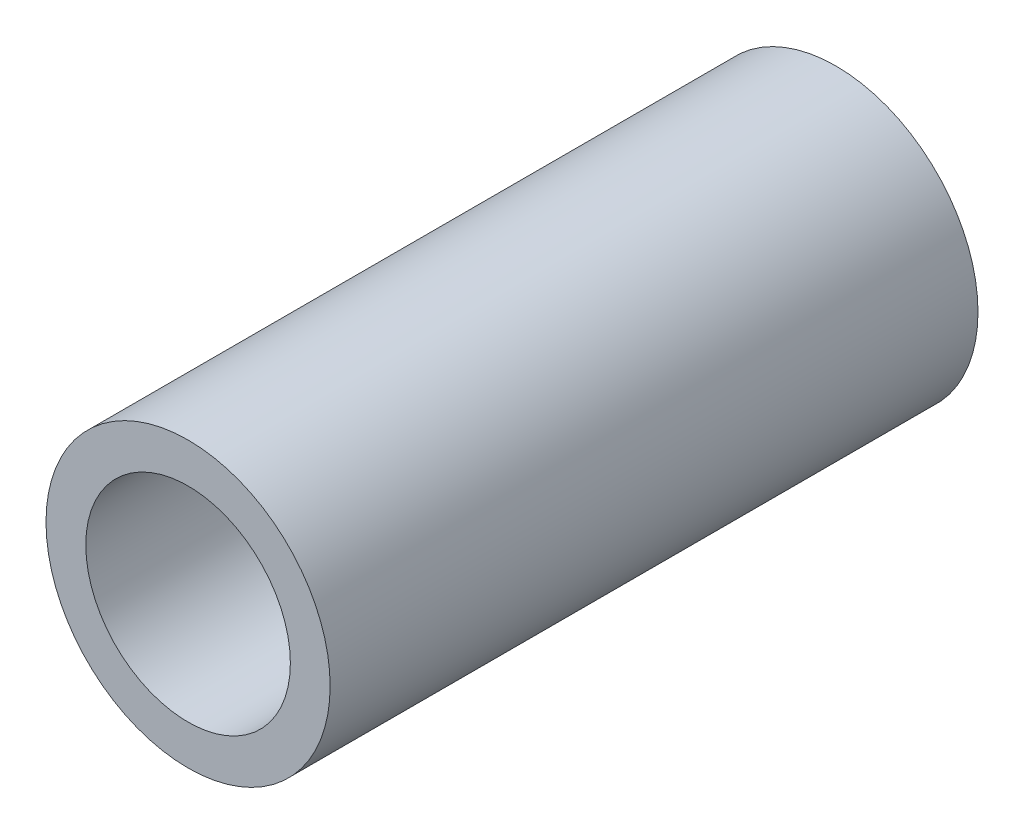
from build123d import *

# Parameters (mm, degrees)
ESQUISSE1_R      = 12.5
ESQUISSE1_R_2    = 9
EXTRUSION1_DEPTH = 28.5


with BuildPart() as part:
    # Esquisse1 → Extrusion1 (new, symmetric)
    with BuildSketch(Plane.XY):
        with Locations(Location((0, 0, 0), (0, 0, 180))):
            Circle(ESQUISSE1_R)
        with Locations(Location((0, 0, 0), (0, 0, 180))):
            Circle(ESQUISSE1_R_2, mode=Mode.SUBTRACT)
    extrude(amount=EXTRUSION1_DEPTH, both=True)


solid = part.part
